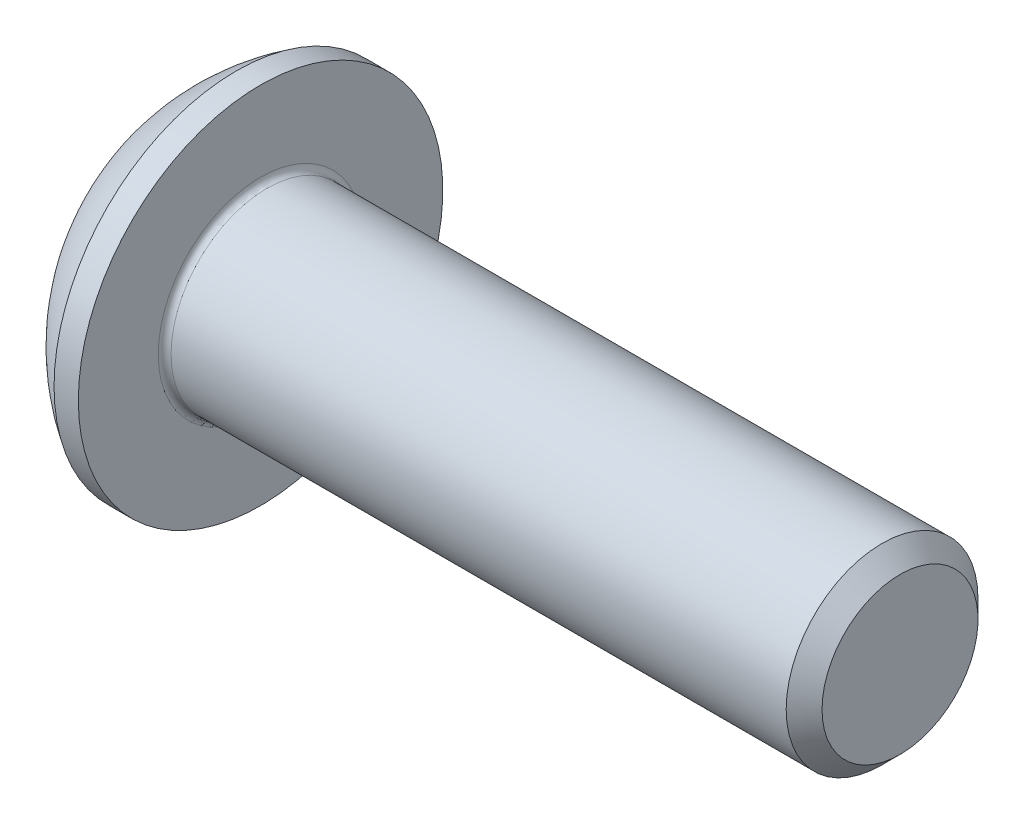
ISO-10303-21;
HEADER;
FILE_DESCRIPTION(('STEP AP214'),'2;1');
FILE_NAME('part.step','',(''),(''),'','','');
FILE_SCHEMA(('AUTOMOTIVE_DESIGN { 1 0 10303 214 1 1 1 1 }'));
ENDSEC;
DATA;
#1=APPLICATION_CONTEXT('core data for automotive mechanical design processes');
#2=APPLICATION_PROTOCOL_DEFINITION('international standard','automotive_design',2000,#1);
#3=PRODUCT_CONTEXT('',#1,'mechanical');
#4=PRODUCT('Part','Part','',(#3));
#5=PRODUCT_RELATED_PRODUCT_CATEGORY('part','',(#4));
#6=PRODUCT_DEFINITION_FORMATION('','',#4);
#7=PRODUCT_DEFINITION_CONTEXT('part definition',#1,'design');
#8=PRODUCT_DEFINITION('design','',#6,#7);
#9=PRODUCT_DEFINITION_SHAPE('','',#8);
#10=(LENGTH_UNIT() NAMED_UNIT(*) SI_UNIT(.MILLI.,.METRE.));
#11=(NAMED_UNIT(*) PLANE_ANGLE_UNIT() SI_UNIT($,.RADIAN.));
#12=(NAMED_UNIT(*) SI_UNIT($,.STERADIAN.) SOLID_ANGLE_UNIT());
#13=UNCERTAINTY_MEASURE_WITH_UNIT(LENGTH_MEASURE(1.E-05),#10,'distance_accuracy_value','');
#14=(GEOMETRIC_REPRESENTATION_CONTEXT(3) GLOBAL_UNCERTAINTY_ASSIGNED_CONTEXT((#13)) GLOBAL_UNIT_ASSIGNED_CONTEXT((#10,
#11,#12)) REPRESENTATION_CONTEXT('',''));
#15=CARTESIAN_POINT('',(0.,0.,0.));
#16=DIRECTION('',(0.,0.,1.));
#17=DIRECTION('',(1.,0.,0.));
#18=AXIS2_PLACEMENT_3D('',#15,#16,#17);
#19=CARTESIAN_POINT('',(0.,0.,0.));
#20=DIRECTION('',(-1.,0.,0.));
#21=DIRECTION('',(0.,0.,1.));
#22=AXIS2_PLACEMENT_3D('',#19,#20,#21);
#23=PLANE('',#22);
#24=CARTESIAN_POINT('',(0.,0.,0.));
#25=DIRECTION('',(-1.,0.,0.));
#26=DIRECTION('',(0.,0.,1.));
#27=AXIS2_PLACEMENT_3D('',#24,#25,#26);
#28=CIRCLE('',#27,1.425);
#29=CARTESIAN_POINT('',(0.,1.425,0.));
#30=VERTEX_POINT('',#29);
#31=EDGE_CURVE('E175',#30,#30,#28,.T.);
#32=ORIENTED_EDGE('',*,*,#31,.T.);
#33=EDGE_LOOP('',(#32));
#34=FACE_BOUND('',#33,.T.);
#35=DIRECTION('',(0.,-1.,0.));
#36=VECTOR('',#35,1.);
#37=CARTESIAN_POINT('',(0.,-0.577350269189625,0.999999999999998));
#38=LINE('',#37,#36);
#39=CARTESIAN_POINT('',(0.,0.577350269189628,1.));
#40=VERTEX_POINT('',#39);
#41=CARTESIAN_POINT('',(0.,-0.577350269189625,0.999999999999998));
#42=VERTEX_POINT('',#41);
#43=EDGE_CURVE('E60',#40,#42,#38,.T.);
#44=ORIENTED_EDGE('',*,*,#43,.T.);
#45=DIRECTION('',(0.,-0.499999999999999,-0.866025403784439));
#46=VECTOR('',#45,1.);
#47=CARTESIAN_POINT('',(0.,-1.15470053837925,0.));
#48=LINE('',#47,#46);
#49=CARTESIAN_POINT('',(0.,-1.15470053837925,0.));
#50=VERTEX_POINT('',#49);
#51=EDGE_CURVE('E302',#42,#50,#48,.T.);
#52=ORIENTED_EDGE('',*,*,#51,.T.);
#53=DIRECTION('',(0.,0.499999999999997,-0.86602540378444));
#54=VECTOR('',#53,1.);
#55=CARTESIAN_POINT('',(0.,-0.577350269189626,-1.));
#56=LINE('',#55,#54);
#57=CARTESIAN_POINT('',(0.,-0.577350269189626,-1.));
#58=VERTEX_POINT('',#57);
#59=EDGE_CURVE('E142',#50,#58,#56,.T.);
#60=ORIENTED_EDGE('',*,*,#59,.T.);
#61=DIRECTION('',(0.,1.,0.));
#62=VECTOR('',#61,1.);
#63=CARTESIAN_POINT('',(0.,0.577350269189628,-1.));
#64=LINE('',#63,#62);
#65=CARTESIAN_POINT('',(0.,0.577350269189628,-1.));
#66=VERTEX_POINT('',#65);
#67=EDGE_CURVE('E307',#58,#66,#64,.T.);
#68=ORIENTED_EDGE('',*,*,#67,.T.);
#69=DIRECTION('',(0.,0.499999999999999,0.866025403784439));
#70=VECTOR('',#69,1.);
#71=CARTESIAN_POINT('',(0.,1.15470053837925,0.));
#72=LINE('',#71,#70);
#73=CARTESIAN_POINT('',(0.,1.15470053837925,0.));
#74=VERTEX_POINT('',#73);
#75=EDGE_CURVE('E310',#66,#74,#72,.T.);
#76=ORIENTED_EDGE('',*,*,#75,.T.);
#77=DIRECTION('',(0.,-0.499999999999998,0.866025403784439));
#78=VECTOR('',#77,1.);
#79=CARTESIAN_POINT('',(0.,0.577350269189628,1.));
#80=LINE('',#79,#78);
#81=EDGE_CURVE('E313',#74,#40,#80,.T.);
#82=ORIENTED_EDGE('',*,*,#81,.T.);
#83=EDGE_LOOP('',(#44,#52,#60,#68,#76,#82));
#84=FACE_BOUND('',#83,.T.);
#85=ADVANCED_FACE('F44',(#34,#84),#23,.T.);
#86=CARTESIAN_POINT('',(3.03337598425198,0.,0.));
#87=DIRECTION('',(-1.,0.,0.));
#88=DIRECTION('',(0.,1.,0.));
#89=AXIS2_PLACEMENT_3D('',#86,#87,#88);
#90=SPHERICAL_SURFACE('',#89,3.35141684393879);
#91=CARTESIAN_POINT('',(1.27,0.,0.));
#92=DIRECTION('',(-1.,0.,0.));
#93=DIRECTION('',(0.,0.,1.));
#94=AXIS2_PLACEMENT_3D('',#91,#92,#93);
#95=CIRCLE('',#94,2.85);
#96=CARTESIAN_POINT('',(1.27,2.85,0.));
#97=VERTEX_POINT('',#96);
#98=EDGE_CURVE('E171',#97,#97,#95,.T.);
#99=CARTESIAN_POINT('',(1.27,2.85,0.));
#100=CARTESIAN_POINT('',(1.2528541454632,2.83939139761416,0.));
#101=CARTESIAN_POINT('',(1.23580404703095,2.82862803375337,0.));
#102=CARTESIAN_POINT('',(1.20190086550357,2.80679536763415,0.));
#103=CARTESIAN_POINT('',(1.18504778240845,2.79572606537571,0.));
#104=CARTESIAN_POINT('',(1.15154413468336,2.77328510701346,0.));
#105=CARTESIAN_POINT('',(1.13489357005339,2.76191345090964,0.));
#106=CARTESIAN_POINT('',(1.10180037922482,2.73887149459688,0.));
#107=CARTESIAN_POINT('',(1.08535775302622,2.72720119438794,0.));
#108=CARTESIAN_POINT('',(1.05268579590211,2.70356574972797,0.));
#109=CARTESIAN_POINT('',(1.03645646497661,2.69160060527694,0.));
#110=CARTESIAN_POINT('',(1.00421638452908,2.66737936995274,0.));
#111=CARTESIAN_POINT('',(0.988205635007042,2.65512327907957,0.));
#112=CARTESIAN_POINT('',(0.956407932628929,2.63032414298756,0.));
#113=CARTESIAN_POINT('',(0.940620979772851,2.61778109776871,0.));
#114=CARTESIAN_POINT('',(0.909276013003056,2.59241213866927,0.));
#115=CARTESIAN_POINT('',(0.89371799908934,2.57958622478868,0.));
#116=CARTESIAN_POINT('',(0.862835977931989,2.55365570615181,0.));
#117=CARTESIAN_POINT('',(0.847511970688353,2.54055110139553,0.));
#118=CARTESIAN_POINT('',(0.817102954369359,2.5140674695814,0.));
#119=CARTESIAN_POINT('',(0.802017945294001,2.50068844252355,0.));
#120=CARTESIAN_POINT('',(0.772091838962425,2.47366032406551,0.));
#121=CARTESIAN_POINT('',(0.757250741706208,2.46001123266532,0.));
#122=CARTESIAN_POINT('',(0.727817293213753,2.43244743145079,0.));
#123=CARTESIAN_POINT('',(0.713224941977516,2.41853272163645,0.));
#124=CARTESIAN_POINT('',(0.68429373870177,2.39044221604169,0.));
#125=CARTESIAN_POINT('',(0.669954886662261,2.37626642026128,0.));
#126=CARTESIAN_POINT('',(0.641535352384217,2.3476583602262,0.));
#127=CARTESIAN_POINT('',(0.627454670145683,2.33322609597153,0.));
#128=CARTESIAN_POINT('',(0.599556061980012,2.30410980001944,0.));
#129=CARTESIAN_POINT('',(0.585738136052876,2.289425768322,0.));
#130=CARTESIAN_POINT('',(0.55836954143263,2.25981072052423,0.));
#131=CARTESIAN_POINT('',(0.54481887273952,2.24487970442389,0.));
#132=CARTESIAN_POINT('',(0.517989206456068,2.21477555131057,0.));
#133=CARTESIAN_POINT('',(0.504710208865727,2.19960241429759,0.));
#134=CARTESIAN_POINT('',(0.478428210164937,2.16901896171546,0.));
#135=CARTESIAN_POINT('',(0.465425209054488,2.15360864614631,0.));
#136=CARTESIAN_POINT('',(0.439699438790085,2.12255585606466,0.));
#137=CARTESIAN_POINT('',(0.426976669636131,2.10691338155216,0.));
#138=CARTESIAN_POINT('',(0.401815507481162,2.07540136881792,0.));
#139=CARTESIAN_POINT('',(0.389377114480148,2.05953183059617,0.));
#140=CARTESIAN_POINT('',(0.364788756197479,2.02757085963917,0.));
#141=CARTESIAN_POINT('',(0.352638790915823,2.0114794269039,0.));
#142=CARTESIAN_POINT('',(0.328631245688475,1.97907990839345,0.));
#143=CARTESIAN_POINT('',(0.316773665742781,1.96277182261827,0.));
#144=CARTESIAN_POINT('',(0.293354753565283,1.92994431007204,0.));
#145=CARTESIAN_POINT('',(0.281793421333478,1.91342488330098,0.));
#146=CARTESIAN_POINT('',(0.258970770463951,1.88018006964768,0.));
#147=CARTESIAN_POINT('',(0.24770945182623,1.86345468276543,0.));
#148=CARTESIAN_POINT('',(0.225490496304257,1.82980339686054,0.));
#149=CARTESIAN_POINT('',(0.214532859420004,1.8128774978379,0.));
#150=CARTESIAN_POINT('',(0.192924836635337,1.77883070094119,0.));
#151=CARTESIAN_POINT('',(0.182274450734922,1.76170980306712,0.));
#152=CARTESIAN_POINT('',(0.161284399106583,1.72727858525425,0.));
#153=CARTESIAN_POINT('',(0.150944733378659,1.70996826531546,0.));
#154=CARTESIAN_POINT('',(0.13057948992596,1.6751638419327,0.));
#155=CARTESIAN_POINT('',(0.120553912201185,1.65766973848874,0.));
#156=CARTESIAN_POINT('',(0.100820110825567,1.62250344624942,0.));
#157=CARTESIAN_POINT('',(0.0911118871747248,1.60483125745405,0.));
#158=CARTESIAN_POINT('',(0.0720159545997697,1.56931455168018,0.));
#159=CARTESIAN_POINT('',(0.062628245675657,1.55147003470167,0.));
#160=CARTESIAN_POINT('',(0.0441764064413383,1.51561448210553,0.));
#161=CARTESIAN_POINT('',(0.0351122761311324,1.49760344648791,0.));
#162=CARTESIAN_POINT('',(0.017310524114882,1.46142073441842,0.));
#163=CARTESIAN_POINT('',(0.00857290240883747,1.44324905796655,0.));
#164=CARTESIAN_POINT('',(0.,1.425,0.));
#165=B_SPLINE_CURVE_WITH_KNOTS('',3,(#99,#100,#101,#102,#103,#104,#105,#106,#107,#108,#109,#110,
#111,#112,#113,#114,#115,#116,#117,#118,#119,#120,#121,#122,#123,#124,#125,#126,#127,#128,#129,
#130,#131,#132,#133,#134,#135,#136,#137,#138,#139,#140,#141,#142,#143,#144,#145,#146,#147,#148,
#149,#150,#151,#152,#153,#154,#155,#156,#157,#158,#159,#160,#161,#162,#163,#164),.UNSPECIFIED.,
.F.,.F.,(4,2,2,2,2,2,2,2,2,2,2,2,2,2,2,2,2,2,2,2,2,2,2,2,2,2,2,2,2,2,2,2,4),(0.,
0.0604864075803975,0.120972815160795,0.181459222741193,0.24194563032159,0.302432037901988,
0.362918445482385,0.423404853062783,0.483891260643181,0.544377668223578,0.604864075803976,
0.665350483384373,0.725836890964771,0.786323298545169,0.846809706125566,0.907296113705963,
0.967782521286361,1.02826892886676,1.08875533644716,1.14924174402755,1.20972815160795,
1.27021455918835,1.33070096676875,1.39118737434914,1.45167378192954,1.51216018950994,
1.57264659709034,1.63313300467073,1.69361941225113,1.75410581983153,1.81459222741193,
1.87507863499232,1.93556504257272),.UNSPECIFIED.);
#166=EDGE_CURVE('BSEAM198',#97,#30,#165,.T.);
#167=ORIENTED_EDGE('',*,*,#98,.T.);
#168=ORIENTED_EDGE('',*,*,#31,.F.);
#169=ORIENTED_EDGE('',*,*,#166,.T.);
#170=ORIENTED_EDGE('',*,*,#166,.F.);
#171=EDGE_LOOP('',(#167,#169,#168,#170));
#172=FACE_BOUND('',#171,.T.);
#173=ADVANCED_FACE('F198',(#172),#90,.T.);
#174=CARTESIAN_POINT('',(0.,0.,0.));
#175=DIRECTION('',(-1.,0.,0.));
#176=DIRECTION('',(0.,0.,1.));
#177=AXIS2_PLACEMENT_3D('',#174,#175,#176);
#178=CYLINDRICAL_SURFACE('',#177,2.85);
#179=ORIENTED_EDGE('',*,*,#98,.F.);
#180=EDGE_LOOP('',(#179));
#181=FACE_BOUND('',#180,.T.);
#182=CARTESIAN_POINT('',(1.65,0.,0.));
#183=DIRECTION('',(-1.,0.,0.));
#184=DIRECTION('',(0.,0.,1.));
#185=AXIS2_PLACEMENT_3D('',#182,#183,#184);
#186=CIRCLE('',#185,2.85);
#187=CARTESIAN_POINT('',(1.65,0.,2.85));
#188=VERTEX_POINT('',#187);
#189=EDGE_CURVE('E167',#188,#188,#186,.T.);
#190=ORIENTED_EDGE('',*,*,#189,.T.);
#191=EDGE_LOOP('',(#190));
#192=FACE_BOUND('',#191,.T.);
#193=ADVANCED_FACE('F203',(#181,#192),#178,.T.);
#194=CARTESIAN_POINT('',(1.65,1.49999999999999,0.));
#195=DIRECTION('',(-1.,0.,0.));
#196=DIRECTION('',(0.,0.,1.));
#197=AXIS2_PLACEMENT_3D('',#194,#195,#196);
#198=PLANE('',#197);
#199=CARTESIAN_POINT('',(1.65,0.,0.));
#200=DIRECTION('',(-1.,0.,0.));
#201=DIRECTION('',(0.,0.,1.));
#202=AXIS2_PLACEMENT_3D('',#199,#200,#201);
#203=CIRCLE('',#202,1.6);
#204=CARTESIAN_POINT('',(1.65,0.,1.6));
#205=VERTEX_POINT('',#204);
#206=EDGE_CURVE('E53',#205,#205,#203,.T.);
#207=ORIENTED_EDGE('',*,*,#206,.T.);
#208=EDGE_LOOP('',(#207));
#209=FACE_BOUND('',#208,.T.);
#210=ORIENTED_EDGE('',*,*,#189,.F.);
#211=EDGE_LOOP('',(#210));
#212=FACE_BOUND('',#211,.T.);
#213=ADVANCED_FACE('F182',(#209,#212),#198,.F.);
#214=CARTESIAN_POINT('',(0.,0.,0.));
#215=DIRECTION('',(-1.,0.,0.));
#216=DIRECTION('',(0.,0.,1.));
#217=AXIS2_PLACEMENT_3D('',#214,#215,#216);
#218=CYLINDRICAL_SURFACE('',#217,1.5);
#219=CARTESIAN_POINT('',(1.75,0.,0.));
#220=DIRECTION('',(-1.,0.,0.));
#221=DIRECTION('',(0.,0.,1.));
#222=AXIS2_PLACEMENT_3D('',#219,#220,#221);
#223=CIRCLE('',#222,1.5);
#224=CARTESIAN_POINT('',(1.75,0.,1.5));
#225=VERTEX_POINT('',#224);
#226=EDGE_CURVE('E11',#225,#225,#223,.F.);
#227=ORIENTED_EDGE('',*,*,#226,.T.);
#228=EDGE_LOOP('',(#227));
#229=FACE_BOUND('',#228,.T.);
#230=CARTESIAN_POINT('',(11.3695,0.,0.));
#231=DIRECTION('',(-1.,0.,0.));
#232=DIRECTION('',(0.,0.,1.));
#233=AXIS2_PLACEMENT_3D('',#230,#231,#232);
#234=CIRCLE('',#233,1.5);
#235=CARTESIAN_POINT('',(11.3695,0.,1.5));
#236=VERTEX_POINT('',#235);
#237=EDGE_CURVE('E163',#236,#236,#234,.T.);
#238=ORIENTED_EDGE('',*,*,#237,.T.);
#239=EDGE_LOOP('',(#238));
#240=FACE_BOUND('',#239,.T.);
#241=ADVANCED_FACE('F212',(#229,#240),#218,.T.);
#242=CARTESIAN_POINT('',(11.65,0.,0.));
#243=DIRECTION('',(-1.,0.,0.));
#244=DIRECTION('',(0.,0.,1.));
#245=AXIS2_PLACEMENT_3D('',#242,#243,#244);
#246=CONICAL_SURFACE('',#245,1.2195,0.785398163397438);
#247=ORIENTED_EDGE('',*,*,#237,.F.);
#248=EDGE_LOOP('',(#247));
#249=FACE_BOUND('',#248,.T.);
#250=CARTESIAN_POINT('',(11.65,0.,0.));
#251=DIRECTION('',(-1.,0.,0.));
#252=DIRECTION('',(0.,0.,1.));
#253=AXIS2_PLACEMENT_3D('',#250,#251,#252);
#254=CIRCLE('',#253,1.2195);
#255=CARTESIAN_POINT('',(11.65,0.,1.2195));
#256=VERTEX_POINT('',#255);
#257=EDGE_CURVE('E158',#256,#256,#254,.T.);
#258=ORIENTED_EDGE('',*,*,#257,.T.);
#259=EDGE_LOOP('',(#258));
#260=FACE_BOUND('',#259,.T.);
#261=ADVANCED_FACE('F193',(#249,#260),#246,.T.);
#262=CARTESIAN_POINT('',(11.65,0.,0.));
#263=DIRECTION('',(-1.,0.,0.));
#264=DIRECTION('',(0.,0.,1.));
#265=AXIS2_PLACEMENT_3D('',#262,#263,#264);
#266=PLANE('',#265);
#267=ORIENTED_EDGE('',*,*,#257,.F.);
#268=EDGE_LOOP('',(#267));
#269=FACE_BOUND('',#268,.T.);
#270=ADVANCED_FACE('F186',(#269),#266,.F.);
#271=CARTESIAN_POINT('',(1.75,0.,0.));
#272=DIRECTION('',(-1.,0.,0.));
#273=DIRECTION('',(0.,0.,1.));
#274=AXIS2_PLACEMENT_3D('',#271,#272,#273);
#275=TOROIDAL_SURFACE('',#274,1.6,0.1);
#276=ORIENTED_EDGE('',*,*,#226,.F.);
#277=EDGE_LOOP('',(#276));
#278=FACE_BOUND('',#277,.T.);
#279=ORIENTED_EDGE('',*,*,#206,.F.);
#280=EDGE_LOOP('',(#279));
#281=FACE_BOUND('',#280,.T.);
#282=ADVANCED_FACE('F46',(#278,#281),#275,.F.);
#283=CARTESIAN_POINT('',(1.04,-1.15470053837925,0.));
#284=DIRECTION('',(0.,0.866025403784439,-0.499999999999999));
#285=DIRECTION('',(0.,0.499999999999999,0.866025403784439));
#286=AXIS2_PLACEMENT_3D('',#283,#284,#285);
#287=PLANE('',#286);
#288=DIRECTION('',(0.,-0.499999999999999,-0.866025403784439));
#289=VECTOR('',#288,1.);
#290=CARTESIAN_POINT('',(1.04,-1.15470053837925,0.));
#291=LINE('',#290,#289);
#292=CARTESIAN_POINT('',(1.04,-0.577350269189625,0.999999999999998));
#293=VERTEX_POINT('',#292);
#294=CARTESIAN_POINT('',(1.04,-0.866025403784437,0.499999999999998));
#295=VERTEX_POINT('',#294);
#296=EDGE_CURVE('E126',#293,#295,#291,.T.);
#297=ORIENTED_EDGE('',*,*,#296,.T.);
#298=CARTESIAN_POINT('',(1.04,-1.15470053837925,0.));
#299=VERTEX_POINT('',#298);
#300=EDGE_CURVE('E121',#295,#299,#291,.T.);
#301=ORIENTED_EDGE('',*,*,#300,.T.);
#302=DIRECTION('',(-1.,0.,0.));
#303=VECTOR('',#302,1.);
#304=CARTESIAN_POINT('',(1.04,-1.15470053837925,0.));
#305=LINE('',#304,#303);
#306=EDGE_CURVE('E123',#299,#50,#305,.T.);
#307=ORIENTED_EDGE('',*,*,#306,.T.);
#308=ORIENTED_EDGE('',*,*,#51,.F.);
#309=DIRECTION('',(-1.,0.,0.));
#310=VECTOR('',#309,1.);
#311=CARTESIAN_POINT('',(1.04,-0.577350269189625,0.999999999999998));
#312=LINE('',#311,#310);
#313=EDGE_CURVE('E301',#293,#42,#312,.T.);
#314=ORIENTED_EDGE('',*,*,#313,.F.);
#315=EDGE_LOOP('',(#297,#301,#307,#308,#314));
#316=FACE_BOUND('',#315,.T.);
#317=ADVANCED_FACE('F122',(#316),#287,.T.);
#318=CARTESIAN_POINT('',(1.04,-0.577350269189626,-1.));
#319=DIRECTION('',(0.,0.86602540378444,0.499999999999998));
#320=DIRECTION('',(0.,-0.499999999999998,0.86602540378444));
#321=AXIS2_PLACEMENT_3D('',#318,#319,#320);
#322=PLANE('',#321);
#323=DIRECTION('',(0.,0.499999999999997,-0.86602540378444));
#324=VECTOR('',#323,1.);
#325=CARTESIAN_POINT('',(1.04,-0.577350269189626,-1.));
#326=LINE('',#325,#324);
#327=CARTESIAN_POINT('',(1.04,-0.86602540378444,-0.499999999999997));
#328=VERTEX_POINT('',#327);
#329=EDGE_CURVE('E68',#299,#328,#326,.T.);
#330=ORIENTED_EDGE('',*,*,#329,.T.);
#331=CARTESIAN_POINT('',(1.04,-0.577350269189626,-1.));
#332=VERTEX_POINT('',#331);
#333=EDGE_CURVE('E137',#328,#332,#326,.T.);
#334=ORIENTED_EDGE('',*,*,#333,.T.);
#335=DIRECTION('',(-1.,0.,0.));
#336=VECTOR('',#335,1.);
#337=CARTESIAN_POINT('',(1.04,-0.577350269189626,-1.));
#338=LINE('',#337,#336);
#339=EDGE_CURVE('E145',#332,#58,#338,.T.);
#340=ORIENTED_EDGE('',*,*,#339,.T.);
#341=ORIENTED_EDGE('',*,*,#59,.F.);
#342=ORIENTED_EDGE('',*,*,#306,.F.);
#343=EDGE_LOOP('',(#330,#334,#340,#341,#342));
#344=FACE_BOUND('',#343,.T.);
#345=ADVANCED_FACE('F140',(#344),#322,.T.);
#346=CARTESIAN_POINT('',(1.04,0.577350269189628,-1.));
#347=DIRECTION('',(0.,0.,1.));
#348=DIRECTION('',(1.,0.,0.));
#349=AXIS2_PLACEMENT_3D('',#346,#347,#348);
#350=PLANE('',#349);
#351=DIRECTION('',(0.,1.,0.));
#352=VECTOR('',#351,1.);
#353=CARTESIAN_POINT('',(1.04,0.577350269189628,-1.));
#354=LINE('',#353,#352);
#355=CARTESIAN_POINT('',(1.04,0.,-1.));
#356=VERTEX_POINT('',#355);
#357=EDGE_CURVE('E276',#332,#356,#354,.T.);
#358=ORIENTED_EDGE('',*,*,#357,.T.);
#359=CARTESIAN_POINT('',(1.04,0.577350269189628,-1.));
#360=VERTEX_POINT('',#359);
#361=EDGE_CURVE('E136',#356,#360,#354,.T.);
#362=ORIENTED_EDGE('',*,*,#361,.T.);
#363=DIRECTION('',(-1.,0.,0.));
#364=VECTOR('',#363,1.);
#365=CARTESIAN_POINT('',(1.04,0.577350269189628,-1.));
#366=LINE('',#365,#364);
#367=EDGE_CURVE('E152',#360,#66,#366,.T.);
#368=ORIENTED_EDGE('',*,*,#367,.T.);
#369=ORIENTED_EDGE('',*,*,#67,.F.);
#370=ORIENTED_EDGE('',*,*,#339,.F.);
#371=EDGE_LOOP('',(#358,#362,#368,#369,#370));
#372=FACE_BOUND('',#371,.T.);
#373=ADVANCED_FACE('F226',(#372),#350,.T.);
#374=CARTESIAN_POINT('',(1.04,1.15470053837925,0.));
#375=DIRECTION('',(0.,-0.86602540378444,0.499999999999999));
#376=DIRECTION('',(0.,-0.499999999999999,-0.866025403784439));
#377=AXIS2_PLACEMENT_3D('',#374,#375,#376);
#378=PLANE('',#377);
#379=DIRECTION('',(0.,0.499999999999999,0.866025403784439));
#380=VECTOR('',#379,1.);
#381=CARTESIAN_POINT('',(1.04,1.15470053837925,0.));
#382=LINE('',#381,#380);
#383=CARTESIAN_POINT('',(1.04,0.86602540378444,-0.499999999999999));
#384=VERTEX_POINT('',#383);
#385=EDGE_CURVE('E263',#360,#384,#382,.T.);
#386=ORIENTED_EDGE('',*,*,#385,.T.);
#387=CARTESIAN_POINT('',(1.04,1.15470053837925,0.));
#388=VERTEX_POINT('',#387);
#389=EDGE_CURVE('E269',#384,#388,#382,.T.);
#390=ORIENTED_EDGE('',*,*,#389,.T.);
#391=DIRECTION('',(-1.,0.,0.));
#392=VECTOR('',#391,1.);
#393=CARTESIAN_POINT('',(1.04,1.15470053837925,0.));
#394=LINE('',#393,#392);
#395=EDGE_CURVE('E325',#388,#74,#394,.T.);
#396=ORIENTED_EDGE('',*,*,#395,.T.);
#397=ORIENTED_EDGE('',*,*,#75,.F.);
#398=ORIENTED_EDGE('',*,*,#367,.F.);
#399=EDGE_LOOP('',(#386,#390,#396,#397,#398));
#400=FACE_BOUND('',#399,.T.);
#401=ADVANCED_FACE('F229',(#400),#378,.T.);
#402=CARTESIAN_POINT('',(1.04,0.577350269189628,1.));
#403=DIRECTION('',(0.,-0.86602540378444,-0.499999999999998));
#404=DIRECTION('',(0.,0.499999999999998,-0.86602540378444));
#405=AXIS2_PLACEMENT_3D('',#402,#403,#404);
#406=PLANE('',#405);
#407=DIRECTION('',(0.,-0.499999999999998,0.866025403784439));
#408=VECTOR('',#407,1.);
#409=CARTESIAN_POINT('',(1.04,0.577350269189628,1.));
#410=LINE('',#409,#408);
#411=CARTESIAN_POINT('',(1.04,0.86602540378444,0.499999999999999));
#412=VERTEX_POINT('',#411);
#413=EDGE_CURVE('E272',#388,#412,#410,.T.);
#414=ORIENTED_EDGE('',*,*,#413,.T.);
#415=CARTESIAN_POINT('',(1.04,0.577350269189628,1.));
#416=VERTEX_POINT('',#415);
#417=EDGE_CURVE('E282',#412,#416,#410,.T.);
#418=ORIENTED_EDGE('',*,*,#417,.T.);
#419=DIRECTION('',(-1.,0.,0.));
#420=VECTOR('',#419,1.);
#421=CARTESIAN_POINT('',(1.04,0.577350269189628,1.));
#422=LINE('',#421,#420);
#423=EDGE_CURVE('E321',#416,#40,#422,.T.);
#424=ORIENTED_EDGE('',*,*,#423,.T.);
#425=ORIENTED_EDGE('',*,*,#81,.F.);
#426=ORIENTED_EDGE('',*,*,#395,.F.);
#427=EDGE_LOOP('',(#414,#418,#424,#425,#426));
#428=FACE_BOUND('',#427,.T.);
#429=ADVANCED_FACE('F233',(#428),#406,.T.);
#430=CARTESIAN_POINT('',(1.04,-0.577350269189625,0.999999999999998));
#431=DIRECTION('',(0.,0.,-1.));
#432=DIRECTION('',(0.,1.,0.));
#433=AXIS2_PLACEMENT_3D('',#430,#431,#432);
#434=PLANE('',#433);
#435=DIRECTION('',(0.,-1.,0.));
#436=VECTOR('',#435,1.);
#437=CARTESIAN_POINT('',(1.04,-0.577350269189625,0.999999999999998));
#438=LINE('',#437,#436);
#439=CARTESIAN_POINT('',(1.04,0.,1.));
#440=VERTEX_POINT('',#439);
#441=EDGE_CURVE('E297',#416,#440,#438,.T.);
#442=ORIENTED_EDGE('',*,*,#441,.T.);
#443=EDGE_CURVE('E296',#440,#293,#438,.T.);
#444=ORIENTED_EDGE('',*,*,#443,.T.);
#445=ORIENTED_EDGE('',*,*,#313,.T.);
#446=ORIENTED_EDGE('',*,*,#43,.F.);
#447=ORIENTED_EDGE('',*,*,#423,.F.);
#448=EDGE_LOOP('',(#442,#444,#445,#446,#447));
#449=FACE_BOUND('',#448,.T.);
#450=ADVANCED_FACE('F237',(#449),#434,.T.);
#451=CARTESIAN_POINT('',(1.04,-1.73205080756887,-1.));
#452=DIRECTION('',(1.,0.,0.));
#453=DIRECTION('',(0.,0.,-1.));
#454=AXIS2_PLACEMENT_3D('',#451,#452,#453);
#455=PLANE('',#454);
#456=CARTESIAN_POINT('',(1.04,0.,0.));
#457=DIRECTION('',(-1.,0.,0.));
#458=DIRECTION('',(0.,0.,1.));
#459=AXIS2_PLACEMENT_3D('',#456,#457,#458);
#460=CIRCLE('',#459,1.);
#461=EDGE_CURVE('E260',#384,#356,#460,.T.);
#462=ORIENTED_EDGE('',*,*,#461,.F.);
#463=ORIENTED_EDGE('',*,*,#385,.F.);
#464=ORIENTED_EDGE('',*,*,#361,.F.);
#465=EDGE_LOOP('',(#462,#463,#464));
#466=FACE_BOUND('',#465,.T.);
#467=ADVANCED_FACE('F241',(#466),#455,.F.);
#468=EDGE_CURVE('E159',#412,#384,#460,.T.);
#469=ORIENTED_EDGE('',*,*,#468,.F.);
#470=ORIENTED_EDGE('',*,*,#413,.F.);
#471=ORIENTED_EDGE('',*,*,#389,.F.);
#472=EDGE_LOOP('',(#469,#470,#471));
#473=FACE_BOUND('',#472,.T.);
#474=ADVANCED_FACE('F250',(#473),#455,.F.);
#475=EDGE_CURVE('E151',#440,#412,#460,.T.);
#476=ORIENTED_EDGE('',*,*,#475,.F.);
#477=ORIENTED_EDGE('',*,*,#441,.F.);
#478=ORIENTED_EDGE('',*,*,#417,.F.);
#479=EDGE_LOOP('',(#476,#477,#478));
#480=FACE_BOUND('',#479,.T.);
#481=ADVANCED_FACE('F255',(#480),#455,.F.);
#482=EDGE_CURVE('E144',#295,#440,#460,.T.);
#483=ORIENTED_EDGE('',*,*,#482,.F.);
#484=ORIENTED_EDGE('',*,*,#296,.F.);
#485=ORIENTED_EDGE('',*,*,#443,.F.);
#486=EDGE_LOOP('',(#483,#484,#485));
#487=FACE_BOUND('',#486,.T.);
#488=ADVANCED_FACE('F248',(#487),#455,.F.);
#489=EDGE_CURVE('E133',#328,#295,#460,.T.);
#490=ORIENTED_EDGE('',*,*,#489,.F.);
#491=ORIENTED_EDGE('',*,*,#329,.F.);
#492=ORIENTED_EDGE('',*,*,#300,.F.);
#493=EDGE_LOOP('',(#490,#491,#492));
#494=FACE_BOUND('',#493,.T.);
#495=ADVANCED_FACE('F132',(#494),#455,.F.);
#496=EDGE_CURVE('E267',#356,#328,#460,.T.);
#497=ORIENTED_EDGE('',*,*,#496,.F.);
#498=ORIENTED_EDGE('',*,*,#357,.F.);
#499=ORIENTED_EDGE('',*,*,#333,.F.);
#500=EDGE_LOOP('',(#497,#498,#499));
#501=FACE_BOUND('',#500,.T.);
#502=ADVANCED_FACE('F221',(#501),#455,.F.);
#503=CARTESIAN_POINT('',(1.61735026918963,0.,0.));
#504=DIRECTION('',(-1.,0.,0.));
#505=DIRECTION('',(0.,0.,1.));
#506=AXIS2_PLACEMENT_3D('',#503,#504,#505);
#507=CONICAL_SURFACE('',#506,0.,1.04719755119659);
#508=ORIENTED_EDGE('',*,*,#475,.T.);
#509=ORIENTED_EDGE('',*,*,#468,.T.);
#510=ORIENTED_EDGE('',*,*,#461,.T.);
#511=ORIENTED_EDGE('',*,*,#496,.T.);
#512=ORIENTED_EDGE('',*,*,#489,.T.);
#513=ORIENTED_EDGE('',*,*,#482,.T.);
#514=EDGE_LOOP('',(#508,#509,#510,#511,#512,#513));
#515=FACE_BOUND('',#514,.T.);
#516=CARTESIAN_POINT('',(1.61735026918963,0.,0.));
#517=VERTEX_POINT('',#516);
#518=VERTEX_LOOP('',#517);
#519=FACE_BOUND('',#518,.T.);
#520=ADVANCED_FACE('F219',(#515,#519),#507,.F.);
#521=CLOSED_SHELL('',(#85,#173,#193,#213,#241,#261,#270,#282,#317,#345,#373,#401,#429,#450,#467,
#474,#481,#488,#495,#502,#520));
#522=MANIFOLD_SOLID_BREP('B2',#521);
#523=ADVANCED_BREP_SHAPE_REPRESENTATION('',(#18,#522),#14);
#524=SHAPE_DEFINITION_REPRESENTATION(#9,#523);
ENDSEC;
END-ISO-10303-21;
